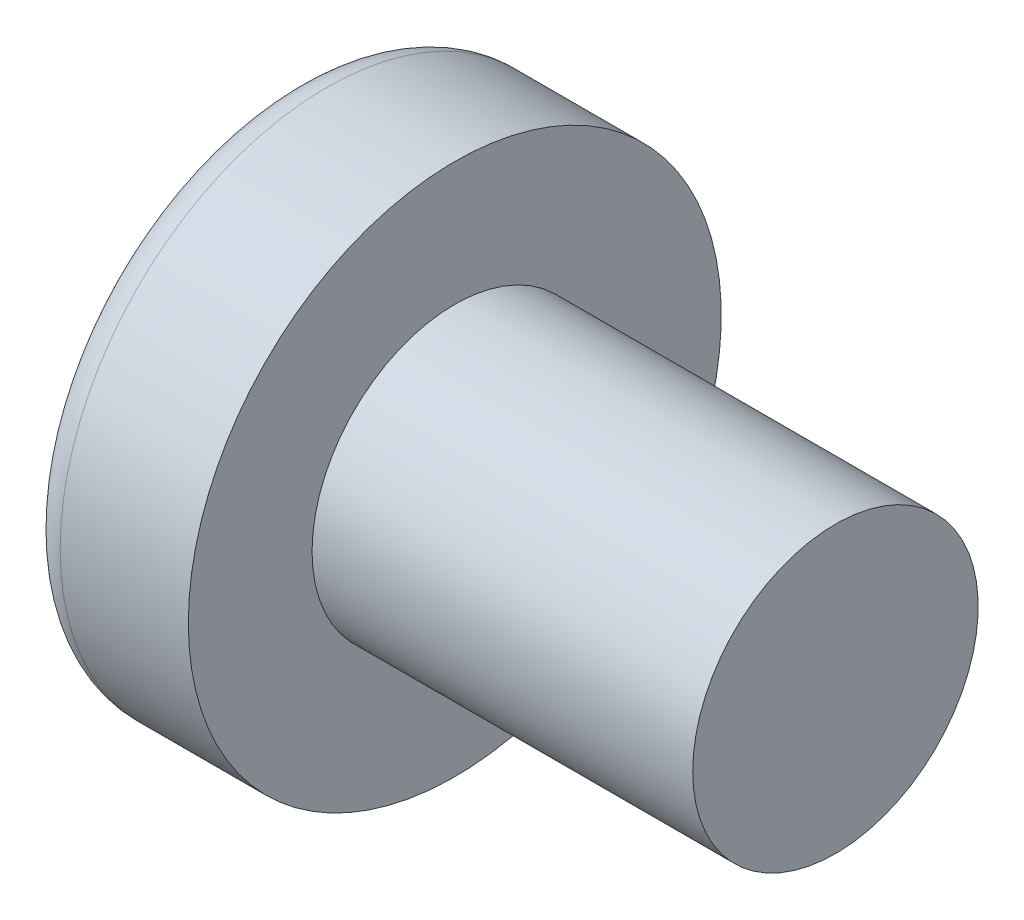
ISO-10303-21;
HEADER;
FILE_DESCRIPTION(('STEP AP214'),'2;1');
FILE_NAME('part.step','',(''),(''),'','','');
FILE_SCHEMA(('AUTOMOTIVE_DESIGN { 1 0 10303 214 1 1 1 1 }'));
ENDSEC;
DATA;
#1=APPLICATION_CONTEXT('core data for automotive mechanical design processes');
#2=APPLICATION_PROTOCOL_DEFINITION('international standard','automotive_design',2000,#1);
#3=PRODUCT_CONTEXT('',#1,'mechanical');
#4=PRODUCT('Part','Part','',(#3));
#5=PRODUCT_RELATED_PRODUCT_CATEGORY('part','',(#4));
#6=PRODUCT_DEFINITION_FORMATION('','',#4);
#7=PRODUCT_DEFINITION_CONTEXT('part definition',#1,'design');
#8=PRODUCT_DEFINITION('design','',#6,#7);
#9=PRODUCT_DEFINITION_SHAPE('','',#8);
#10=(LENGTH_UNIT() NAMED_UNIT(*) SI_UNIT(.MILLI.,.METRE.));
#11=(NAMED_UNIT(*) PLANE_ANGLE_UNIT() SI_UNIT($,.RADIAN.));
#12=(NAMED_UNIT(*) SI_UNIT($,.STERADIAN.) SOLID_ANGLE_UNIT());
#13=UNCERTAINTY_MEASURE_WITH_UNIT(LENGTH_MEASURE(1.E-05),#10,'distance_accuracy_value','');
#14=(GEOMETRIC_REPRESENTATION_CONTEXT(3) GLOBAL_UNCERTAINTY_ASSIGNED_CONTEXT((#13)) GLOBAL_UNIT_ASSIGNED_CONTEXT((#10,
#11,#12)) REPRESENTATION_CONTEXT('',''));
#15=CARTESIAN_POINT('',(0.,0.,0.));
#16=DIRECTION('',(0.,0.,1.));
#17=DIRECTION('',(1.,0.,0.));
#18=AXIS2_PLACEMENT_3D('',#15,#16,#17);
#19=CARTESIAN_POINT('',(5.,0.,0.));
#20=DIRECTION('',(-1.,0.,0.));
#21=DIRECTION('',(0.,1.,0.));
#22=AXIS2_PLACEMENT_3D('',#19,#20,#21);
#23=SPHERICAL_SURFACE('',#22,5.);
#24=CARTESIAN_POINT('',(0.747150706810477,0.,0.));
#25=DIRECTION('',(-1.,0.,0.));
#26=DIRECTION('',(0.,0.,1.));
#27=AXIS2_PLACEMENT_3D('',#24,#25,#26);
#28=CIRCLE('',#27,2.62931034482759);
#29=CARTESIAN_POINT('',(0.747150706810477,0.,2.62931034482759));
#30=VERTEX_POINT('',#29);
#31=EDGE_CURVE('E152',#30,#30,#28,.T.);
#32=ORIENTED_EDGE('',*,*,#31,.T.);
#33=EDGE_LOOP('',(#32));
#34=FACE_BOUND('',#33,.T.);
#35=CARTESIAN_POINT('',(4.98382636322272,-0.153868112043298,0.));
#36=DIRECTION('',(-0.104537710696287,-0.994520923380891,0.));
#37=DIRECTION('',(0.994520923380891,-0.104537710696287,0.));
#38=AXIS2_PLACEMENT_3D('',#35,#36,#37);
#39=CIRCLE('',#38,4.99760572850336);
#40=CARTESIAN_POINT('',(0.188596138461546,0.350175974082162,1.31444652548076));
#41=VERTEX_POINT('',#40);
#42=CARTESIAN_POINT('',(0.0270341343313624,0.367158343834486,0.367158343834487));
#43=VERTEX_POINT('',#42);
#44=EDGE_CURVE('E183',#41,#43,#39,.T.);
#45=ORIENTED_EDGE('',*,*,#44,.F.);
#46=CARTESIAN_POINT('',(3.98403090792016,0.,-1.41352221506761));
#47=DIRECTION('',(0.583636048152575,0.,0.812015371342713));
#48=DIRECTION('',(0.812015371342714,0.,-0.583636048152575));
#49=AXIS2_PLACEMENT_3D('',#46,#47,#48);
#50=CIRCLE('',#49,4.68719124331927);
#51=CARTESIAN_POINT('',(0.188596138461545,-0.350175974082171,1.31444652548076));
#52=VERTEX_POINT('',#51);
#53=EDGE_CURVE('E148',#41,#52,#50,.T.);
#54=ORIENTED_EDGE('',*,*,#53,.T.);
#55=CARTESIAN_POINT('',(4.98382636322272,0.153868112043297,0.));
#56=DIRECTION('',(-0.104537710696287,0.994520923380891,0.));
#57=DIRECTION('',(-0.994520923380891,-0.104537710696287,0.));
#58=AXIS2_PLACEMENT_3D('',#55,#56,#57);
#59=CIRCLE('',#58,4.99760572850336);
#60=CARTESIAN_POINT('',(0.0270341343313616,-0.367158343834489,0.367158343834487));
#61=VERTEX_POINT('',#60);
#62=EDGE_CURVE('E104',#61,#52,#59,.T.);
#63=ORIENTED_EDGE('',*,*,#62,.F.);
#64=CARTESIAN_POINT('',(4.98382636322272,0.,-0.153868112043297));
#65=DIRECTION('',(-0.104537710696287,0.,-0.994520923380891));
#66=DIRECTION('',(-0.994520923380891,0.,0.104537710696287));
#67=AXIS2_PLACEMENT_3D('',#64,#65,#66);
#68=CIRCLE('',#67,4.99760572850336);
#69=CARTESIAN_POINT('',(0.188596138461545,-1.31444652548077,0.350175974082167));
#70=VERTEX_POINT('',#69);
#71=EDGE_CURVE('E129',#70,#61,#68,.T.);
#72=ORIENTED_EDGE('',*,*,#71,.F.);
#73=CARTESIAN_POINT('',(3.98403090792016,1.41352221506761,0.));
#74=DIRECTION('',(0.583636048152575,-0.812015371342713,0.));
#75=DIRECTION('',(0.812015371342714,0.583636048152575,0.));
#76=AXIS2_PLACEMENT_3D('',#73,#74,#75);
#77=CIRCLE('',#76,4.68719124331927);
#78=CARTESIAN_POINT('',(0.188596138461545,-1.31444652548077,-0.350175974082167));
#79=VERTEX_POINT('',#78);
#80=EDGE_CURVE('E137',#70,#79,#77,.T.);
#81=ORIENTED_EDGE('',*,*,#80,.T.);
#82=CARTESIAN_POINT('',(4.98382636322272,0.,0.153868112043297));
#83=DIRECTION('',(-0.104537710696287,0.,0.994520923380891));
#84=DIRECTION('',(0.994520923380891,0.,0.104537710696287));
#85=AXIS2_PLACEMENT_3D('',#82,#83,#84);
#86=CIRCLE('',#85,4.99760572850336);
#87=CARTESIAN_POINT('',(0.0270341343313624,-0.367158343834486,-0.367158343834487));
#88=VERTEX_POINT('',#87);
#89=EDGE_CURVE('E47',#88,#79,#86,.T.);
#90=ORIENTED_EDGE('',*,*,#89,.F.);
#91=CARTESIAN_POINT('',(0.188596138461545,-0.350175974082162,-1.31444652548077));
#92=VERTEX_POINT('',#91);
#93=EDGE_CURVE('E190',#92,#88,#59,.T.);
#94=ORIENTED_EDGE('',*,*,#93,.F.);
#95=CARTESIAN_POINT('',(3.98403090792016,0.,1.41352221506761));
#96=DIRECTION('',(0.583636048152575,0.,-0.812015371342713));
#97=DIRECTION('',(-0.812015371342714,0.,-0.583636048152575));
#98=AXIS2_PLACEMENT_3D('',#95,#96,#97);
#99=CIRCLE('',#98,4.68719124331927);
#100=CARTESIAN_POINT('',(0.188596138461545,0.350175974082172,-1.31444652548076));
#101=VERTEX_POINT('',#100);
#102=EDGE_CURVE('E130',#92,#101,#99,.T.);
#103=ORIENTED_EDGE('',*,*,#102,.T.);
#104=CARTESIAN_POINT('',(0.0270341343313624,0.367158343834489,-0.367158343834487));
#105=VERTEX_POINT('',#104);
#106=EDGE_CURVE('E178',#105,#101,#39,.T.);
#107=ORIENTED_EDGE('',*,*,#106,.F.);
#108=CARTESIAN_POINT('',(0.188596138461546,1.31444652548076,-0.350175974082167));
#109=VERTEX_POINT('',#108);
#110=EDGE_CURVE('E40',#109,#105,#86,.T.);
#111=ORIENTED_EDGE('',*,*,#110,.F.);
#112=CARTESIAN_POINT('',(3.98403090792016,-1.41352221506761,0.));
#113=DIRECTION('',(0.583636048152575,0.812015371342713,0.));
#114=DIRECTION('',(-0.812015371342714,0.583636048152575,0.));
#115=AXIS2_PLACEMENT_3D('',#112,#113,#114);
#116=CIRCLE('',#115,4.68719124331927);
#117=CARTESIAN_POINT('',(0.188596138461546,1.31444652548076,0.350175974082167));
#118=VERTEX_POINT('',#117);
#119=EDGE_CURVE('E11',#109,#118,#116,.T.);
#120=ORIENTED_EDGE('',*,*,#119,.T.);
#121=EDGE_CURVE('E166',#43,#118,#68,.T.);
#122=ORIENTED_EDGE('',*,*,#121,.F.);
#123=EDGE_LOOP('',(#45,#54,#63,#72,#81,#90,#94,#103,#107,#111,#120,#122));
#124=FACE_BOUND('',#123,.T.);
#125=ADVANCED_FACE('F32',(#34,#124),#23,.T.);
#126=CARTESIAN_POINT('',(2.01739130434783,0.,-0.15794466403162));
#127=DIRECTION('',(-0.104537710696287,0.,0.994520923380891));
#128=DIRECTION('',(0.994520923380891,0.,0.104537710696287));
#129=AXIS2_PLACEMENT_3D('',#126,#127,#128);
#130=PLANE('',#129);
#131=ORIENTED_EDGE('',*,*,#110,.T.);
#132=DIRECTION('',(0.989130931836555,-0.103971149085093,0.103971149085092));
#133=VECTOR('',#132,1.);
#134=CARTESIAN_POINT('',(2.03363450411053,0.156237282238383,-0.156237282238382));
#135=LINE('',#134,#133);
#136=CARTESIAN_POINT('',(1.76,0.185000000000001,-0.184999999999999));
#137=VERTEX_POINT('',#136);
#138=EDGE_CURVE('E172',#105,#137,#135,.T.);
#139=ORIENTED_EDGE('',*,*,#138,.T.);
#140=DIRECTION('',(0.80907355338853,-0.581521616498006,0.0850446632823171));
#141=VECTOR('',#140,1.);
#142=CARTESIAN_POINT('',(0.,1.45,-0.37));
#143=LINE('',#142,#141);
#144=EDGE_CURVE('E153',#109,#137,#143,.T.);
#145=ORIENTED_EDGE('',*,*,#144,.F.);
#146=EDGE_LOOP('',(#131,#139,#145));
#147=FACE_BOUND('',#146,.T.);
#148=ADVANCED_FACE('F171',(#147),#130,.T.);
#149=DIRECTION('',(0.80907355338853,0.581521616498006,0.0850446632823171));
#150=VECTOR('',#149,1.);
#151=CARTESIAN_POINT('',(0.,-1.45,-0.37));
#152=LINE('',#151,#150);
#153=CARTESIAN_POINT('',(1.76,-0.185,-0.185));
#154=VERTEX_POINT('',#153);
#155=EDGE_CURVE('E138',#79,#154,#152,.T.);
#156=ORIENTED_EDGE('',*,*,#155,.T.);
#157=DIRECTION('',(-0.989130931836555,-0.103971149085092,-0.103971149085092));
#158=VECTOR('',#157,1.);
#159=CARTESIAN_POINT('',(2.03363450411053,-0.156237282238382,-0.156237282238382));
#160=LINE('',#159,#158);
#161=EDGE_CURVE('E193',#154,#88,#160,.T.);
#162=ORIENTED_EDGE('',*,*,#161,.T.);
#163=ORIENTED_EDGE('',*,*,#89,.T.);
#164=EDGE_LOOP('',(#156,#162,#163));
#165=FACE_BOUND('',#164,.T.);
#166=ADVANCED_FACE('F208',(#165),#130,.T.);
#167=CARTESIAN_POINT('',(2.01739130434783,0.,0.157944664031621));
#168=DIRECTION('',(-0.104537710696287,0.,-0.994520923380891));
#169=DIRECTION('',(-0.994520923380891,0.,0.104537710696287));
#170=AXIS2_PLACEMENT_3D('',#167,#168,#169);
#171=PLANE('',#170);
#172=DIRECTION('',(0.80907355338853,-0.581521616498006,-0.085044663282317));
#173=VECTOR('',#172,1.);
#174=CARTESIAN_POINT('',(0.,1.45,0.37));
#175=LINE('',#174,#173);
#176=CARTESIAN_POINT('',(1.76,0.185,0.185));
#177=VERTEX_POINT('',#176);
#178=EDGE_CURVE('E209',#118,#177,#175,.T.);
#179=ORIENTED_EDGE('',*,*,#178,.T.);
#180=DIRECTION('',(-0.989130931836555,0.103971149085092,0.103971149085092));
#181=VECTOR('',#180,1.);
#182=CARTESIAN_POINT('',(2.03363450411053,0.156237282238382,0.156237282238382));
#183=LINE('',#182,#181);
#184=EDGE_CURVE('E187',#177,#43,#183,.T.);
#185=ORIENTED_EDGE('',*,*,#184,.T.);
#186=ORIENTED_EDGE('',*,*,#121,.T.);
#187=EDGE_LOOP('',(#179,#185,#186));
#188=FACE_BOUND('',#187,.T.);
#189=ADVANCED_FACE('F213',(#188),#171,.T.);
#190=ORIENTED_EDGE('',*,*,#71,.T.);
#191=DIRECTION('',(0.989130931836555,0.103971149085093,-0.103971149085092));
#192=VECTOR('',#191,1.);
#193=CARTESIAN_POINT('',(2.03363450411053,-0.156237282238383,0.156237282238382));
#194=LINE('',#193,#192);
#195=CARTESIAN_POINT('',(1.76,-0.185000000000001,0.184999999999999));
#196=VERTEX_POINT('',#195);
#197=EDGE_CURVE('E102',#61,#196,#194,.T.);
#198=ORIENTED_EDGE('',*,*,#197,.T.);
#199=DIRECTION('',(0.80907355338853,0.581521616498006,-0.0850446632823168));
#200=VECTOR('',#199,1.);
#201=CARTESIAN_POINT('',(0.,-1.45,0.369999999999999));
#202=LINE('',#201,#200);
#203=EDGE_CURVE('E127',#70,#196,#202,.T.);
#204=ORIENTED_EDGE('',*,*,#203,.F.);
#205=EDGE_LOOP('',(#190,#198,#204));
#206=FACE_BOUND('',#205,.T.);
#207=ADVANCED_FACE('F126',(#206),#171,.T.);
#208=CARTESIAN_POINT('',(-25.4,0.,0.));
#209=DIRECTION('',(-1.,0.,0.));
#210=DIRECTION('',(0.,0.,1.));
#211=AXIS2_PLACEMENT_3D('',#208,#209,#210);
#212=CYLINDRICAL_SURFACE('',#211,1.5);
#213=CARTESIAN_POINT('',(6.4,0.,0.));
#214=DIRECTION('',(-1.,0.,0.));
#215=DIRECTION('',(0.,0.,1.));
#216=AXIS2_PLACEMENT_3D('',#213,#214,#215);
#217=CIRCLE('',#216,1.5);
#218=CARTESIAN_POINT('',(6.4,0.,1.5));
#219=VERTEX_POINT('',#218);
#220=EDGE_CURVE('E149',#219,#219,#217,.T.);
#221=ORIENTED_EDGE('',*,*,#220,.T.);
#222=EDGE_LOOP('',(#221));
#223=FACE_BOUND('',#222,.T.);
#224=CARTESIAN_POINT('',(2.4,0.,0.));
#225=DIRECTION('',(-1.,0.,0.));
#226=DIRECTION('',(0.,0.,1.));
#227=AXIS2_PLACEMENT_3D('',#224,#225,#226);
#228=CIRCLE('',#227,1.5);
#229=CARTESIAN_POINT('',(2.4,0.,1.5));
#230=VERTEX_POINT('',#229);
#231=EDGE_CURVE('E162',#230,#230,#228,.T.);
#232=ORIENTED_EDGE('',*,*,#231,.F.);
#233=EDGE_LOOP('',(#232));
#234=FACE_BOUND('',#233,.T.);
#235=ADVANCED_FACE('F34',(#223,#234),#212,.T.);
#236=CARTESIAN_POINT('',(2.4,1.5,0.));
#237=DIRECTION('',(-1.,0.,0.));
#238=DIRECTION('',(0.,0.,1.));
#239=AXIS2_PLACEMENT_3D('',#236,#237,#238);
#240=PLANE('',#239);
#241=CARTESIAN_POINT('',(2.4,0.,0.));
#242=DIRECTION('',(-1.,0.,0.));
#243=DIRECTION('',(0.,0.,1.));
#244=AXIS2_PLACEMENT_3D('',#241,#242,#243);
#245=CIRCLE('',#244,2.8);
#246=CARTESIAN_POINT('',(2.4,0.,2.8));
#247=VERTEX_POINT('',#246);
#248=EDGE_CURVE('E159',#247,#247,#245,.T.);
#249=ORIENTED_EDGE('',*,*,#248,.F.);
#250=EDGE_LOOP('',(#249));
#251=FACE_BOUND('',#250,.T.);
#252=ORIENTED_EDGE('',*,*,#231,.T.);
#253=EDGE_LOOP('',(#252));
#254=FACE_BOUND('',#253,.T.);
#255=ADVANCED_FACE('F241',(#251,#254),#240,.F.);
#256=CARTESIAN_POINT('',(-25.4,0.,0.));
#257=DIRECTION('',(-1.,0.,0.));
#258=DIRECTION('',(0.,0.,1.));
#259=AXIS2_PLACEMENT_3D('',#256,#257,#258);
#260=CYLINDRICAL_SURFACE('',#259,2.8);
#261=ORIENTED_EDGE('',*,*,#248,.T.);
#262=EDGE_LOOP('',(#261));
#263=FACE_BOUND('',#262,.T.);
#264=CARTESIAN_POINT('',(1.05335585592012,0.,0.));
#265=DIRECTION('',(-1.,0.,0.));
#266=DIRECTION('',(0.,0.,1.));
#267=AXIS2_PLACEMENT_3D('',#264,#265,#266);
#268=CIRCLE('',#267,2.8);
#269=CARTESIAN_POINT('',(1.05335585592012,0.,2.8));
#270=VERTEX_POINT('',#269);
#271=EDGE_CURVE('E156',#270,#270,#268,.T.);
#272=ORIENTED_EDGE('',*,*,#271,.F.);
#273=EDGE_LOOP('',(#272));
#274=FACE_BOUND('',#273,.T.);
#275=ADVANCED_FACE('F238',(#263,#274),#260,.T.);
#276=CARTESIAN_POINT('',(1.05335585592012,0.,0.));
#277=DIRECTION('',(-1.,0.,0.));
#278=DIRECTION('',(0.,0.,1.));
#279=AXIS2_PLACEMENT_3D('',#276,#277,#278);
#280=TOROIDAL_SURFACE('',#279,2.44,0.360000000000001);
#281=ORIENTED_EDGE('',*,*,#271,.T.);
#282=EDGE_LOOP('',(#281));
#283=FACE_BOUND('',#282,.T.);
#284=ORIENTED_EDGE('',*,*,#31,.F.);
#285=EDGE_LOOP('',(#284));
#286=FACE_BOUND('',#285,.T.);
#287=ADVANCED_FACE('F235',(#283,#286),#280,.T.);
#288=CARTESIAN_POINT('',(6.4,1.5,0.));
#289=DIRECTION('',(1.,0.,0.));
#290=DIRECTION('',(0.,0.,-1.));
#291=AXIS2_PLACEMENT_3D('',#288,#289,#290);
#292=PLANE('',#291);
#293=ORIENTED_EDGE('',*,*,#220,.F.);
#294=EDGE_LOOP('',(#293));
#295=FACE_BOUND('',#294,.T.);
#296=ADVANCED_FACE('F233',(#295),#292,.T.);
#297=CARTESIAN_POINT('',(1.76,0.185,0.185));
#298=DIRECTION('',(0.583636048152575,0.812015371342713,0.));
#299=DIRECTION('',(-0.812015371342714,0.583636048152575,0.));
#300=AXIS2_PLACEMENT_3D('',#297,#298,#299);
#301=PLANE('',#300);
#302=ORIENTED_EDGE('',*,*,#144,.T.);
#303=DIRECTION('',(0.,0.,-1.));
#304=VECTOR('',#303,1.);
#305=CARTESIAN_POINT('',(1.76,0.185,0.185));
#306=LINE('',#305,#304);
#307=EDGE_CURVE('E120',#177,#137,#306,.T.);
#308=ORIENTED_EDGE('',*,*,#307,.F.);
#309=ORIENTED_EDGE('',*,*,#178,.F.);
#310=ORIENTED_EDGE('',*,*,#119,.F.);
#311=EDGE_LOOP('',(#302,#308,#309,#310));
#312=FACE_BOUND('',#311,.T.);
#313=ADVANCED_FACE('F212',(#312),#301,.F.);
#314=CARTESIAN_POINT('',(1.76,-0.185,-0.185));
#315=DIRECTION('',(0.583636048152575,-0.812015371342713,0.));
#316=DIRECTION('',(0.812015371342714,0.583636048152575,0.));
#317=AXIS2_PLACEMENT_3D('',#314,#315,#316);
#318=PLANE('',#317);
#319=ORIENTED_EDGE('',*,*,#203,.T.);
#320=DIRECTION('',(0.,0.,1.));
#321=VECTOR('',#320,1.);
#322=CARTESIAN_POINT('',(1.76,-0.185,-0.185));
#323=LINE('',#322,#321);
#324=EDGE_CURVE('E119',#154,#196,#323,.T.);
#325=ORIENTED_EDGE('',*,*,#324,.F.);
#326=ORIENTED_EDGE('',*,*,#155,.F.);
#327=ORIENTED_EDGE('',*,*,#80,.F.);
#328=EDGE_LOOP('',(#319,#325,#326,#327));
#329=FACE_BOUND('',#328,.T.);
#330=ADVANCED_FACE('F134',(#329),#318,.F.);
#331=CARTESIAN_POINT('',(1.76,0.185,-0.185));
#332=DIRECTION('',(-1.,0.,0.));
#333=DIRECTION('',(0.,0.,1.));
#334=AXIS2_PLACEMENT_3D('',#331,#332,#333);
#335=PLANE('',#334);
#336=DIRECTION('',(0.,1.,0.));
#337=VECTOR('',#336,1.);
#338=CARTESIAN_POINT('',(1.76,-0.185,-0.185));
#339=LINE('',#338,#337);
#340=EDGE_CURVE('E142',#154,#137,#339,.T.);
#341=ORIENTED_EDGE('',*,*,#340,.F.);
#342=ORIENTED_EDGE('',*,*,#324,.T.);
#343=DIRECTION('',(0.,-1.,0.));
#344=VECTOR('',#343,1.);
#345=CARTESIAN_POINT('',(1.76,0.185,0.185));
#346=LINE('',#345,#344);
#347=EDGE_CURVE('E111',#177,#196,#346,.T.);
#348=ORIENTED_EDGE('',*,*,#347,.F.);
#349=ORIENTED_EDGE('',*,*,#307,.T.);
#350=EDGE_LOOP('',(#341,#342,#348,#349));
#351=FACE_BOUND('',#350,.T.);
#352=ADVANCED_FACE('F140',(#351),#335,.T.);
#353=CARTESIAN_POINT('',(1.76,0.185000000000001,-0.184999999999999));
#354=DIRECTION('',(0.583636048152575,0.,-0.812015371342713));
#355=DIRECTION('',(0.812015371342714,0.,0.583636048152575));
#356=AXIS2_PLACEMENT_3D('',#353,#354,#355);
#357=PLANE('',#356);
#358=DIRECTION('',(0.80907355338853,0.0850446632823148,0.581521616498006));
#359=VECTOR('',#358,1.);
#360=CARTESIAN_POINT('',(0.,-0.369999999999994,-1.45));
#361=LINE('',#360,#359);
#362=EDGE_CURVE('E198',#92,#154,#361,.T.);
#363=ORIENTED_EDGE('',*,*,#362,.T.);
#364=ORIENTED_EDGE('',*,*,#340,.T.);
#365=DIRECTION('',(0.80907355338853,-0.0850446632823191,0.581521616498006));
#366=VECTOR('',#365,1.);
#367=CARTESIAN_POINT('',(0.,0.370000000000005,-1.45));
#368=LINE('',#367,#366);
#369=EDGE_CURVE('E108',#101,#137,#368,.T.);
#370=ORIENTED_EDGE('',*,*,#369,.F.);
#371=ORIENTED_EDGE('',*,*,#102,.F.);
#372=EDGE_LOOP('',(#363,#364,#370,#371));
#373=FACE_BOUND('',#372,.T.);
#374=ADVANCED_FACE('F203',(#373),#357,.F.);
#375=CARTESIAN_POINT('',(2.01739130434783,-0.157944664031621,0.));
#376=DIRECTION('',(-0.104537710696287,0.994520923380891,0.));
#377=DIRECTION('',(-0.994520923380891,-0.104537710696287,0.));
#378=AXIS2_PLACEMENT_3D('',#375,#376,#377);
#379=PLANE('',#378);
#380=ORIENTED_EDGE('',*,*,#93,.T.);
#381=ORIENTED_EDGE('',*,*,#161,.F.);
#382=ORIENTED_EDGE('',*,*,#362,.F.);
#383=EDGE_LOOP('',(#380,#381,#382));
#384=FACE_BOUND('',#383,.T.);
#385=ADVANCED_FACE('F207',(#384),#379,.T.);
#386=CARTESIAN_POINT('',(2.01739130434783,0.15794466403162,0.));
#387=DIRECTION('',(-0.104537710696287,-0.994520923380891,0.));
#388=DIRECTION('',(0.994520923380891,-0.104537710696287,0.));
#389=AXIS2_PLACEMENT_3D('',#386,#387,#388);
#390=PLANE('',#389);
#391=ORIENTED_EDGE('',*,*,#106,.T.);
#392=ORIENTED_EDGE('',*,*,#369,.T.);
#393=ORIENTED_EDGE('',*,*,#138,.F.);
#394=EDGE_LOOP('',(#391,#392,#393));
#395=FACE_BOUND('',#394,.T.);
#396=ADVANCED_FACE('F201',(#395),#390,.T.);
#397=CARTESIAN_POINT('',(1.76,-0.185000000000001,0.184999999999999));
#398=DIRECTION('',(0.583636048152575,0.,0.812015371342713));
#399=DIRECTION('',(-0.812015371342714,0.,0.583636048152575));
#400=AXIS2_PLACEMENT_3D('',#397,#398,#399);
#401=PLANE('',#400);
#402=DIRECTION('',(0.80907355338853,-0.0850446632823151,-0.581521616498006));
#403=VECTOR('',#402,1.);
#404=CARTESIAN_POINT('',(0.,0.369999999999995,1.45));
#405=LINE('',#404,#403);
#406=EDGE_CURVE('E107',#41,#177,#405,.T.);
#407=ORIENTED_EDGE('',*,*,#406,.T.);
#408=ORIENTED_EDGE('',*,*,#347,.T.);
#409=DIRECTION('',(0.80907355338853,0.085044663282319,-0.581521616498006));
#410=VECTOR('',#409,1.);
#411=CARTESIAN_POINT('',(0.,-0.370000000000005,1.45));
#412=LINE('',#411,#410);
#413=EDGE_CURVE('E98',#52,#196,#412,.T.);
#414=ORIENTED_EDGE('',*,*,#413,.F.);
#415=ORIENTED_EDGE('',*,*,#53,.F.);
#416=EDGE_LOOP('',(#407,#408,#414,#415));
#417=FACE_BOUND('',#416,.T.);
#418=ADVANCED_FACE('F112',(#417),#401,.F.);
#419=ORIENTED_EDGE('',*,*,#44,.T.);
#420=ORIENTED_EDGE('',*,*,#184,.F.);
#421=ORIENTED_EDGE('',*,*,#406,.F.);
#422=EDGE_LOOP('',(#419,#420,#421));
#423=FACE_BOUND('',#422,.T.);
#424=ADVANCED_FACE('F214',(#423),#390,.T.);
#425=ORIENTED_EDGE('',*,*,#62,.T.);
#426=ORIENTED_EDGE('',*,*,#413,.T.);
#427=ORIENTED_EDGE('',*,*,#197,.F.);
#428=EDGE_LOOP('',(#425,#426,#427));
#429=FACE_BOUND('',#428,.T.);
#430=ADVANCED_FACE('F100',(#429),#379,.T.);
#431=CLOSED_SHELL('',(#125,#148,#166,#189,#207,#235,#255,#275,#287,#296,#313,#330,#352,#374,
#385,#396,#418,#424,#430));
#432=MANIFOLD_SOLID_BREP('B2',#431);
#433=ADVANCED_BREP_SHAPE_REPRESENTATION('',(#18,#432),#14);
#434=SHAPE_DEFINITION_REPRESENTATION(#9,#433);
ENDSEC;
END-ISO-10303-21;
